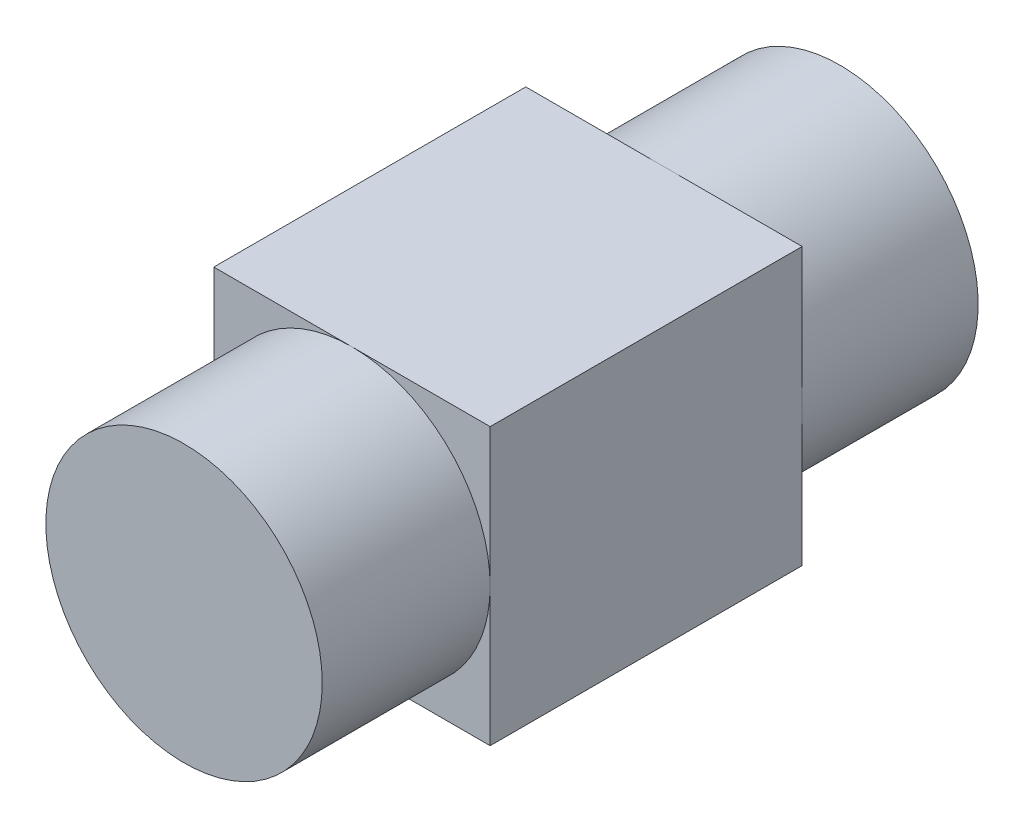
ISO-10303-21;
HEADER;
FILE_DESCRIPTION(('STEP AP214'),'2;1');
FILE_NAME('part.step','',(''),(''),'','','');
FILE_SCHEMA(('AUTOMOTIVE_DESIGN { 1 0 10303 214 1 1 1 1 }'));
ENDSEC;
DATA;
#1=APPLICATION_CONTEXT('core data for automotive mechanical design processes');
#2=APPLICATION_PROTOCOL_DEFINITION('international standard','automotive_design',2000,#1);
#3=PRODUCT_CONTEXT('',#1,'mechanical');
#4=PRODUCT('Part','Part','',(#3));
#5=PRODUCT_RELATED_PRODUCT_CATEGORY('part','',(#4));
#6=PRODUCT_DEFINITION_FORMATION('','',#4);
#7=PRODUCT_DEFINITION_CONTEXT('part definition',#1,'design');
#8=PRODUCT_DEFINITION('design','',#6,#7);
#9=PRODUCT_DEFINITION_SHAPE('','',#8);
#10=(LENGTH_UNIT() NAMED_UNIT(*) SI_UNIT(.MILLI.,.METRE.));
#11=(NAMED_UNIT(*) PLANE_ANGLE_UNIT() SI_UNIT($,.RADIAN.));
#12=(NAMED_UNIT(*) SI_UNIT($,.STERADIAN.) SOLID_ANGLE_UNIT());
#13=UNCERTAINTY_MEASURE_WITH_UNIT(LENGTH_MEASURE(1.E-05),#10,'distance_accuracy_value','');
#14=(GEOMETRIC_REPRESENTATION_CONTEXT(3) GLOBAL_UNCERTAINTY_ASSIGNED_CONTEXT((#13)) GLOBAL_UNIT_ASSIGNED_CONTEXT((#10,
#11,#12)) REPRESENTATION_CONTEXT('',''));
#15=CARTESIAN_POINT('',(0.,0.,0.));
#16=DIRECTION('',(0.,0.,1.));
#17=DIRECTION('',(1.,0.,0.));
#18=AXIS2_PLACEMENT_3D('',#15,#16,#17);
#19=CARTESIAN_POINT('',(0.,0.,0.));
#20=DIRECTION('',(0.,0.,1.));
#21=DIRECTION('',(1.,0.,0.));
#22=AXIS2_PLACEMENT_3D('',#19,#20,#21);
#23=CYLINDRICAL_SURFACE('',#22,4.7625);
#24=CARTESIAN_POINT('',(0.,0.,30.19552));
#25=DIRECTION('',(0.,0.,1.));
#26=DIRECTION('',(1.,0.,0.));
#27=AXIS2_PLACEMENT_3D('',#24,#25,#26);
#28=CIRCLE('',#27,4.7625);
#29=CARTESIAN_POINT('',(4.7625,0.,30.19552));
#30=VERTEX_POINT('',#29);
#31=CARTESIAN_POINT('',(0.,4.7625,30.19552));
#32=VERTEX_POINT('',#31);
#33=EDGE_CURVE('E137',#30,#32,#28,.T.);
#34=ORIENTED_EDGE('',*,*,#33,.F.);
#35=CARTESIAN_POINT('',(0.,-4.7625,30.19552));
#36=VERTEX_POINT('',#35);
#37=EDGE_CURVE('E113',#36,#30,#28,.T.);
#38=ORIENTED_EDGE('',*,*,#37,.F.);
#39=CARTESIAN_POINT('',(-4.7625,0.,30.19552));
#40=VERTEX_POINT('',#39);
#41=EDGE_CURVE('E170',#40,#36,#28,.T.);
#42=ORIENTED_EDGE('',*,*,#41,.F.);
#43=EDGE_CURVE('E141',#32,#40,#28,.T.);
#44=ORIENTED_EDGE('',*,*,#43,.F.);
#45=EDGE_LOOP('',(#34,#38,#42,#44));
#46=FACE_BOUND('',#45,.T.);
#47=CARTESIAN_POINT('',(1.11022302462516E-13,0.,24.13));
#48=DIRECTION('',(0.,0.,-1.));
#49=DIRECTION('',(-1.,0.,0.));
#50=AXIS2_PLACEMENT_3D('',#47,#48,#49);
#51=CIRCLE('',#50,4.76249999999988);
#52=CARTESIAN_POINT('',(-4.76249999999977,0.,24.13));
#53=VERTEX_POINT('',#52);
#54=EDGE_CURVE('E199',#53,#53,#51,.T.);
#55=ORIENTED_EDGE('',*,*,#54,.F.);
#56=EDGE_LOOP('',(#55));
#57=FACE_BOUND('',#56,.T.);
#58=ADVANCED_FACE('F41',(#46,#57),#23,.T.);
#59=CARTESIAN_POINT('',(4.7625,4.7625,59.436));
#60=DIRECTION('',(-1.,0.,0.));
#61=DIRECTION('',(0.,0.,1.));
#62=AXIS2_PLACEMENT_3D('',#59,#60,#61);
#63=PLANE('',#62);
#64=DIRECTION('',(0.,1.,0.));
#65=VECTOR('',#64,1.);
#66=CARTESIAN_POINT('',(4.7625,4.7625,40.9483600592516));
#67=LINE('',#66,#65);
#68=CARTESIAN_POINT('',(4.7625,-4.7625,40.9483600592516));
#69=VERTEX_POINT('',#68);
#70=CARTESIAN_POINT('',(4.76250000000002,0.,40.9483600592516));
#71=VERTEX_POINT('',#70);
#72=EDGE_CURVE('E108',#69,#71,#67,.T.);
#73=ORIENTED_EDGE('',*,*,#72,.F.);
#74=DIRECTION('',(0.,0.,-1.));
#75=VECTOR('',#74,1.);
#76=CARTESIAN_POINT('',(4.7625,-4.7625,59.436));
#77=LINE('',#76,#75);
#78=CARTESIAN_POINT('',(4.7625,-4.7625,30.19552));
#79=VERTEX_POINT('',#78);
#80=EDGE_CURVE('E64',#69,#79,#77,.T.);
#81=ORIENTED_EDGE('',*,*,#80,.T.);
#82=DIRECTION('',(0.,1.,0.));
#83=VECTOR('',#82,1.);
#84=CARTESIAN_POINT('',(4.7625,4.7625,30.19552));
#85=LINE('',#84,#83);
#86=EDGE_CURVE('E151',#79,#30,#85,.T.);
#87=ORIENTED_EDGE('',*,*,#86,.T.);
#88=CARTESIAN_POINT('',(4.7625,4.7625,30.19552));
#89=VERTEX_POINT('',#88);
#90=EDGE_CURVE('E149',#30,#89,#85,.T.);
#91=ORIENTED_EDGE('',*,*,#90,.T.);
#92=DIRECTION('',(0.,0.,-1.));
#93=VECTOR('',#92,1.);
#94=CARTESIAN_POINT('',(4.7625,4.7625,59.436));
#95=LINE('',#94,#93);
#96=CARTESIAN_POINT('',(4.7625,4.7625,40.9483600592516));
#97=VERTEX_POINT('',#96);
#98=EDGE_CURVE('E132',#97,#89,#95,.T.);
#99=ORIENTED_EDGE('',*,*,#98,.F.);
#100=EDGE_CURVE('E114',#71,#97,#67,.T.);
#101=ORIENTED_EDGE('',*,*,#100,.F.);
#102=EDGE_LOOP('',(#73,#81,#87,#91,#99,#101));
#103=FACE_BOUND('',#102,.T.);
#104=ADVANCED_FACE('F43',(#103),#63,.F.);
#105=CARTESIAN_POINT('',(-4.7625,4.7625,59.436));
#106=DIRECTION('',(0.,-1.,0.));
#107=DIRECTION('',(0.,0.,-1.));
#108=AXIS2_PLACEMENT_3D('',#105,#106,#107);
#109=PLANE('',#108);
#110=DIRECTION('',(-1.,0.,0.));
#111=VECTOR('',#110,1.);
#112=CARTESIAN_POINT('',(-4.7625,4.7625,40.9483600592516));
#113=LINE('',#112,#111);
#114=CARTESIAN_POINT('',(0.,4.76250000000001,40.9483600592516));
#115=VERTEX_POINT('',#114);
#116=EDGE_CURVE('E126',#97,#115,#113,.T.);
#117=ORIENTED_EDGE('',*,*,#116,.F.);
#118=ORIENTED_EDGE('',*,*,#98,.T.);
#119=DIRECTION('',(-1.,0.,0.));
#120=VECTOR('',#119,1.);
#121=CARTESIAN_POINT('',(-4.7625,4.7625,30.19552));
#122=LINE('',#121,#120);
#123=EDGE_CURVE('E148',#89,#32,#122,.T.);
#124=ORIENTED_EDGE('',*,*,#123,.T.);
#125=CARTESIAN_POINT('',(-4.7625,4.7625,30.19552));
#126=VERTEX_POINT('',#125);
#127=EDGE_CURVE('E145',#32,#126,#122,.T.);
#128=ORIENTED_EDGE('',*,*,#127,.T.);
#129=DIRECTION('',(0.,0.,-1.));
#130=VECTOR('',#129,1.);
#131=CARTESIAN_POINT('',(-4.7625,4.7625,59.436));
#132=LINE('',#131,#130);
#133=CARTESIAN_POINT('',(-4.7625,4.7625,40.9483600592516));
#134=VERTEX_POINT('',#133);
#135=EDGE_CURVE('E155',#134,#126,#132,.T.);
#136=ORIENTED_EDGE('',*,*,#135,.F.);
#137=EDGE_CURVE('E133',#115,#134,#113,.T.);
#138=ORIENTED_EDGE('',*,*,#137,.F.);
#139=EDGE_LOOP('',(#117,#118,#124,#128,#136,#138));
#140=FACE_BOUND('',#139,.T.);
#141=ADVANCED_FACE('F184',(#140),#109,.F.);
#142=CARTESIAN_POINT('',(-4.7625,4.7625,59.436));
#143=DIRECTION('',(1.,0.,0.));
#144=DIRECTION('',(0.,1.,0.));
#145=AXIS2_PLACEMENT_3D('',#142,#143,#144);
#146=PLANE('',#145);
#147=DIRECTION('',(0.,-1.,0.));
#148=VECTOR('',#147,1.);
#149=CARTESIAN_POINT('',(-4.7625,4.7625,40.9483600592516));
#150=LINE('',#149,#148);
#151=CARTESIAN_POINT('',(-4.7625,0.,40.9483600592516));
#152=VERTEX_POINT('',#151);
#153=EDGE_CURVE('E204',#134,#152,#150,.T.);
#154=ORIENTED_EDGE('',*,*,#153,.F.);
#155=ORIENTED_EDGE('',*,*,#135,.T.);
#156=DIRECTION('',(0.,-1.,0.));
#157=VECTOR('',#156,1.);
#158=CARTESIAN_POINT('',(-4.7625,4.7625,30.19552));
#159=LINE('',#158,#157);
#160=EDGE_CURVE('E144',#126,#40,#159,.T.);
#161=ORIENTED_EDGE('',*,*,#160,.T.);
#162=CARTESIAN_POINT('',(-4.7625,-4.7625,30.19552));
#163=VERTEX_POINT('',#162);
#164=EDGE_CURVE('E140',#40,#163,#159,.T.);
#165=ORIENTED_EDGE('',*,*,#164,.T.);
#166=DIRECTION('',(0.,0.,-1.));
#167=VECTOR('',#166,1.);
#168=CARTESIAN_POINT('',(-4.7625,-4.7625,59.436));
#169=LINE('',#168,#167);
#170=CARTESIAN_POINT('',(-4.7625,-4.7625,40.9483600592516));
#171=VERTEX_POINT('',#170);
#172=EDGE_CURVE('E153',#171,#163,#169,.T.);
#173=ORIENTED_EDGE('',*,*,#172,.F.);
#174=EDGE_CURVE('E128',#152,#171,#150,.T.);
#175=ORIENTED_EDGE('',*,*,#174,.F.);
#176=EDGE_LOOP('',(#154,#155,#161,#165,#173,#175));
#177=FACE_BOUND('',#176,.T.);
#178=ADVANCED_FACE('F174',(#177),#146,.F.);
#179=CARTESIAN_POINT('',(-4.7625,-4.7625,59.436));
#180=DIRECTION('',(0.,1.,0.));
#181=DIRECTION('',(0.,0.,1.));
#182=AXIS2_PLACEMENT_3D('',#179,#180,#181);
#183=PLANE('',#182);
#184=DIRECTION('',(1.,0.,0.));
#185=VECTOR('',#184,1.);
#186=CARTESIAN_POINT('',(-4.7625,-4.7625,40.9483600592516));
#187=LINE('',#186,#185);
#188=CARTESIAN_POINT('',(0.,-4.7625,40.9483600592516));
#189=VERTEX_POINT('',#188);
#190=EDGE_CURVE('E12',#171,#189,#187,.T.);
#191=ORIENTED_EDGE('',*,*,#190,.F.);
#192=ORIENTED_EDGE('',*,*,#172,.T.);
#193=DIRECTION('',(1.,0.,0.));
#194=VECTOR('',#193,1.);
#195=CARTESIAN_POINT('',(-4.7625,-4.7625,30.19552));
#196=LINE('',#195,#194);
#197=EDGE_CURVE('E159',#163,#36,#196,.T.);
#198=ORIENTED_EDGE('',*,*,#197,.T.);
#199=EDGE_CURVE('E157',#36,#79,#196,.T.);
#200=ORIENTED_EDGE('',*,*,#199,.T.);
#201=ORIENTED_EDGE('',*,*,#80,.F.);
#202=EDGE_CURVE('E45',#189,#69,#187,.T.);
#203=ORIENTED_EDGE('',*,*,#202,.F.);
#204=EDGE_LOOP('',(#191,#192,#198,#200,#201,#203));
#205=FACE_BOUND('',#204,.T.);
#206=ADVANCED_FACE('F164',(#205),#183,.F.);
#207=CARTESIAN_POINT('',(0.,0.,30.19552));
#208=DIRECTION('',(0.,0.,1.));
#209=DIRECTION('',(1.,0.,0.));
#210=AXIS2_PLACEMENT_3D('',#207,#208,#209);
#211=PLANE('',#210);
#212=ORIENTED_EDGE('',*,*,#199,.F.);
#213=ORIENTED_EDGE('',*,*,#37,.T.);
#214=ORIENTED_EDGE('',*,*,#86,.F.);
#215=EDGE_LOOP('',(#212,#213,#214));
#216=FACE_BOUND('',#215,.T.);
#217=ADVANCED_FACE('F191',(#216),#211,.F.);
#218=ORIENTED_EDGE('',*,*,#33,.T.);
#219=ORIENTED_EDGE('',*,*,#123,.F.);
#220=ORIENTED_EDGE('',*,*,#90,.F.);
#221=EDGE_LOOP('',(#218,#219,#220));
#222=FACE_BOUND('',#221,.T.);
#223=ADVANCED_FACE('F187',(#222),#211,.F.);
#224=ORIENTED_EDGE('',*,*,#43,.T.);
#225=ORIENTED_EDGE('',*,*,#160,.F.);
#226=ORIENTED_EDGE('',*,*,#127,.F.);
#227=EDGE_LOOP('',(#224,#225,#226));
#228=FACE_BOUND('',#227,.T.);
#229=ADVANCED_FACE('F180',(#228),#211,.F.);
#230=ORIENTED_EDGE('',*,*,#41,.T.);
#231=ORIENTED_EDGE('',*,*,#197,.F.);
#232=ORIENTED_EDGE('',*,*,#164,.F.);
#233=EDGE_LOOP('',(#230,#231,#232));
#234=FACE_BOUND('',#233,.T.);
#235=ADVANCED_FACE('F168',(#234),#211,.F.);
#236=CARTESIAN_POINT('',(-9.87422504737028,0.,40.9483600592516));
#237=DIRECTION('',(0.,0.,1.));
#238=DIRECTION('',(1.,0.,0.));
#239=AXIS2_PLACEMENT_3D('',#236,#237,#238);
#240=PLANE('',#239);
#241=ORIENTED_EDGE('',*,*,#72,.T.);
#242=CARTESIAN_POINT('',(0.,0.,40.9483600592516));
#243=DIRECTION('',(0.,0.,1.));
#244=DIRECTION('',(1.,0.,0.));
#245=AXIS2_PLACEMENT_3D('',#242,#243,#244);
#246=CIRCLE('',#245,4.76250000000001);
#247=EDGE_CURVE('E110',#189,#71,#246,.T.);
#248=ORIENTED_EDGE('',*,*,#247,.F.);
#249=ORIENTED_EDGE('',*,*,#202,.T.);
#250=EDGE_LOOP('',(#241,#248,#249));
#251=FACE_BOUND('',#250,.T.);
#252=ADVANCED_FACE('F109',(#251),#240,.T.);
#253=ORIENTED_EDGE('',*,*,#100,.T.);
#254=ORIENTED_EDGE('',*,*,#116,.T.);
#255=EDGE_CURVE('E119',#71,#115,#246,.T.);
#256=ORIENTED_EDGE('',*,*,#255,.F.);
#257=EDGE_LOOP('',(#253,#254,#256));
#258=FACE_BOUND('',#257,.T.);
#259=ADVANCED_FACE('F124',(#258),#240,.T.);
#260=ORIENTED_EDGE('',*,*,#137,.T.);
#261=ORIENTED_EDGE('',*,*,#153,.T.);
#262=EDGE_CURVE('E129',#115,#152,#246,.T.);
#263=ORIENTED_EDGE('',*,*,#262,.F.);
#264=EDGE_LOOP('',(#260,#261,#263));
#265=FACE_BOUND('',#264,.T.);
#266=ADVANCED_FACE('F207',(#265),#240,.T.);
#267=ORIENTED_EDGE('',*,*,#174,.T.);
#268=ORIENTED_EDGE('',*,*,#190,.T.);
#269=EDGE_CURVE('E56',#152,#189,#246,.T.);
#270=ORIENTED_EDGE('',*,*,#269,.F.);
#271=EDGE_LOOP('',(#267,#268,#270));
#272=FACE_BOUND('',#271,.T.);
#273=ADVANCED_FACE('F209',(#272),#240,.T.);
#274=CARTESIAN_POINT('',(0.,0.,63.8384776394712));
#275=DIRECTION('',(0.,0.,1.));
#276=DIRECTION('',(1.,0.,0.));
#277=AXIS2_PLACEMENT_3D('',#274,#275,#276);
#278=CYLINDRICAL_SURFACE('',#277,4.76250000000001);
#279=CARTESIAN_POINT('',(0.,0.,46.736));
#280=DIRECTION('',(0.,0.,1.));
#281=DIRECTION('',(1.,0.,0.));
#282=AXIS2_PLACEMENT_3D('',#279,#280,#281);
#283=CIRCLE('',#282,4.76250000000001);
#284=CARTESIAN_POINT('',(4.76250000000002,0.,46.736));
#285=VERTEX_POINT('',#284);
#286=EDGE_CURVE('E121',#285,#285,#283,.T.);
#287=ORIENTED_EDGE('',*,*,#286,.F.);
#288=EDGE_LOOP('',(#287));
#289=FACE_BOUND('',#288,.T.);
#290=ORIENTED_EDGE('',*,*,#247,.T.);
#291=ORIENTED_EDGE('',*,*,#255,.T.);
#292=ORIENTED_EDGE('',*,*,#262,.T.);
#293=ORIENTED_EDGE('',*,*,#269,.T.);
#294=EDGE_LOOP('',(#290,#291,#292,#293));
#295=FACE_BOUND('',#294,.T.);
#296=ADVANCED_FACE('F118',(#289,#295),#278,.T.);
#297=CARTESIAN_POINT('',(-4.7625,0.,46.736));
#298=DIRECTION('',(0.,0.,1.));
#299=DIRECTION('',(1.,0.,0.));
#300=AXIS2_PLACEMENT_3D('',#297,#298,#299);
#301=PLANE('',#300);
#302=ORIENTED_EDGE('',*,*,#286,.T.);
#303=EDGE_LOOP('',(#302));
#304=FACE_BOUND('',#303,.T.);
#305=ADVANCED_FACE('F243',(#304),#301,.T.);
#306=CARTESIAN_POINT('',(1.11022302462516E-13,0.,24.13));
#307=DIRECTION('',(0.,0.,-1.));
#308=DIRECTION('',(-1.,0.,0.));
#309=AXIS2_PLACEMENT_3D('',#306,#307,#308);
#310=PLANE('',#309);
#311=ORIENTED_EDGE('',*,*,#54,.T.);
#312=EDGE_LOOP('',(#311));
#313=FACE_BOUND('',#312,.T.);
#314=ADVANCED_FACE('F247',(#313),#310,.T.);
#315=CLOSED_SHELL('',(#58,#104,#141,#178,#206,#217,#223,#229,#235,#252,#259,#266,#273,#296,#305,#314));
#316=MANIFOLD_SOLID_BREP('B2',#315);
#317=ADVANCED_BREP_SHAPE_REPRESENTATION('',(#18,#316),#14);
#318=SHAPE_DEFINITION_REPRESENTATION(#9,#317);
ENDSEC;
END-ISO-10303-21;
